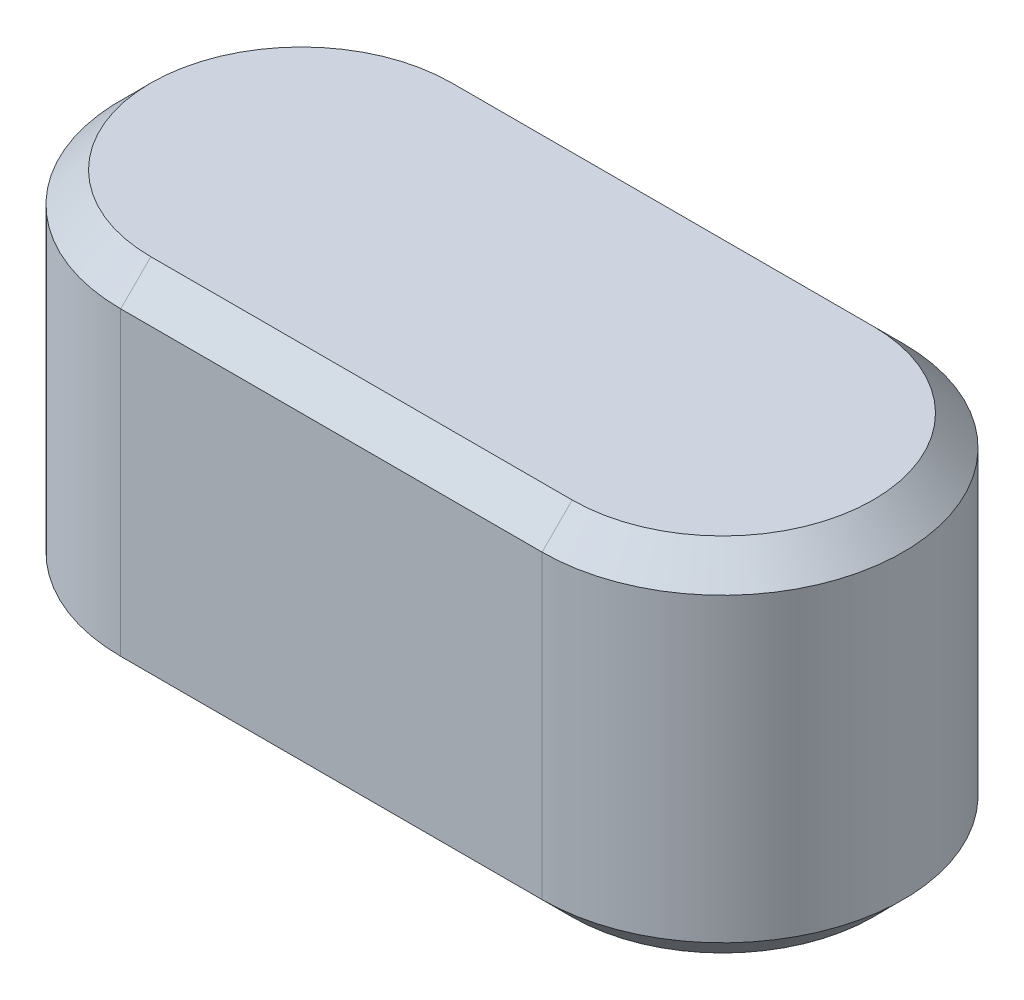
ISO-10303-21;
HEADER;
FILE_DESCRIPTION(('STEP AP214'),'2;1');
FILE_NAME('part.step','',(''),(''),'','','');
FILE_SCHEMA(('AUTOMOTIVE_DESIGN { 1 0 10303 214 1 1 1 1 }'));
ENDSEC;
DATA;
#1=APPLICATION_CONTEXT('core data for automotive mechanical design processes');
#2=APPLICATION_PROTOCOL_DEFINITION('international standard','automotive_design',2000,#1);
#3=PRODUCT_CONTEXT('',#1,'mechanical');
#4=PRODUCT('Part','Part','',(#3));
#5=PRODUCT_RELATED_PRODUCT_CATEGORY('part','',(#4));
#6=PRODUCT_DEFINITION_FORMATION('','',#4);
#7=PRODUCT_DEFINITION_CONTEXT('part definition',#1,'design');
#8=PRODUCT_DEFINITION('design','',#6,#7);
#9=PRODUCT_DEFINITION_SHAPE('','',#8);
#10=(LENGTH_UNIT() NAMED_UNIT(*) SI_UNIT(.MILLI.,.METRE.));
#11=(NAMED_UNIT(*) PLANE_ANGLE_UNIT() SI_UNIT($,.RADIAN.));
#12=(NAMED_UNIT(*) SI_UNIT($,.STERADIAN.) SOLID_ANGLE_UNIT());
#13=UNCERTAINTY_MEASURE_WITH_UNIT(LENGTH_MEASURE(1.E-05),#10,'distance_accuracy_value','');
#14=(GEOMETRIC_REPRESENTATION_CONTEXT(3) GLOBAL_UNCERTAINTY_ASSIGNED_CONTEXT((#13)) GLOBAL_UNIT_ASSIGNED_CONTEXT((#10,
#11,#12)) REPRESENTATION_CONTEXT('',''));
#15=CARTESIAN_POINT('',(0.,0.,0.));
#16=DIRECTION('',(0.,0.,1.));
#17=DIRECTION('',(1.,0.,0.));
#18=AXIS2_PLACEMENT_3D('',#15,#16,#17);
#19=CARTESIAN_POINT('',(3.5,6.00000000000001,0.));
#20=DIRECTION('',(0.,-1.,0.));
#21=DIRECTION('',(0.,0.,-1.));
#22=AXIS2_PLACEMENT_3D('',#19,#20,#21);
#23=CYLINDRICAL_SURFACE('',#22,2.99999999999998);
#24=DIRECTION('',(0.,-1.,0.));
#25=VECTOR('',#24,1.);
#26=CARTESIAN_POINT('',(3.5,6.00000000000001,-2.99999999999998));
#27=LINE('',#26,#25);
#28=CARTESIAN_POINT('',(3.5,5.49999999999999,-2.99999999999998));
#29=VERTEX_POINT('',#28);
#30=CARTESIAN_POINT('',(3.5,0.500000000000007,-2.99999999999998));
#31=VERTEX_POINT('',#30);
#32=EDGE_CURVE('E110',#29,#31,#27,.T.);
#33=ORIENTED_EDGE('',*,*,#32,.F.);
#34=CARTESIAN_POINT('',(3.5,5.49999999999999,0.));
#35=DIRECTION('',(0.,-1.,0.));
#36=DIRECTION('',(0.,0.,-1.));
#37=AXIS2_PLACEMENT_3D('',#34,#35,#36);
#38=CIRCLE('',#37,2.99999999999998);
#39=CARTESIAN_POINT('',(3.5,5.49999999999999,2.99999999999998));
#40=VERTEX_POINT('',#39);
#41=EDGE_CURVE('E134',#29,#40,#38,.T.);
#42=ORIENTED_EDGE('',*,*,#41,.T.);
#43=DIRECTION('',(0.,-1.,0.));
#44=VECTOR('',#43,1.);
#45=CARTESIAN_POINT('',(3.5,6.00000000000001,2.99999999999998));
#46=LINE('',#45,#44);
#47=CARTESIAN_POINT('',(3.5,0.500000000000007,2.99999999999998));
#48=VERTEX_POINT('',#47);
#49=EDGE_CURVE('E161',#40,#48,#46,.T.);
#50=ORIENTED_EDGE('',*,*,#49,.T.);
#51=CARTESIAN_POINT('',(3.5,0.500000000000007,0.));
#52=DIRECTION('',(0.,-1.,0.));
#53=DIRECTION('',(0.,0.,-1.));
#54=AXIS2_PLACEMENT_3D('',#51,#52,#53);
#55=CIRCLE('',#54,2.99999999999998);
#56=EDGE_CURVE('E132',#48,#31,#55,.F.);
#57=ORIENTED_EDGE('',*,*,#56,.T.);
#58=EDGE_LOOP('',(#33,#42,#50,#57));
#59=FACE_BOUND('',#58,.T.);
#60=ADVANCED_FACE('F27',(#59),#23,.T.);
#61=CARTESIAN_POINT('',(-3.5,6.00000000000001,-2.99999999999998));
#62=DIRECTION('',(0.,0.,1.));
#63=DIRECTION('',(1.,0.,0.));
#64=AXIS2_PLACEMENT_3D('',#61,#62,#63);
#65=PLANE('',#64);
#66=DIRECTION('',(0.,-1.,0.));
#67=VECTOR('',#66,1.);
#68=CARTESIAN_POINT('',(-3.5,6.00000000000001,-2.99999999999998));
#69=LINE('',#68,#67);
#70=CARTESIAN_POINT('',(-3.5,5.49999999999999,-2.99999999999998));
#71=VERTEX_POINT('',#70);
#72=CARTESIAN_POINT('',(-3.5,0.500000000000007,-2.99999999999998));
#73=VERTEX_POINT('',#72);
#74=EDGE_CURVE('E167',#71,#73,#69,.T.);
#75=ORIENTED_EDGE('',*,*,#74,.F.);
#76=DIRECTION('',(1.,0.,0.));
#77=VECTOR('',#76,1.);
#78=CARTESIAN_POINT('',(-3.5,5.49999999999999,-2.99999999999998));
#79=LINE('',#78,#77);
#80=EDGE_CURVE('E130',#71,#29,#79,.T.);
#81=ORIENTED_EDGE('',*,*,#80,.T.);
#82=ORIENTED_EDGE('',*,*,#32,.T.);
#83=DIRECTION('',(-1.,0.,0.));
#84=VECTOR('',#83,1.);
#85=CARTESIAN_POINT('',(-3.5,0.500000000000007,-2.99999999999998));
#86=LINE('',#85,#84);
#87=EDGE_CURVE('E127',#31,#73,#86,.T.);
#88=ORIENTED_EDGE('',*,*,#87,.T.);
#89=EDGE_LOOP('',(#75,#81,#82,#88));
#90=FACE_BOUND('',#89,.T.);
#91=ADVANCED_FACE('F192',(#90),#65,.F.);
#92=CARTESIAN_POINT('',(-3.5,6.00000000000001,0.));
#93=DIRECTION('',(0.,-1.,0.));
#94=DIRECTION('',(0.,0.,-1.));
#95=AXIS2_PLACEMENT_3D('',#92,#93,#94);
#96=CYLINDRICAL_SURFACE('',#95,2.99999999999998);
#97=DIRECTION('',(0.,-1.,0.));
#98=VECTOR('',#97,1.);
#99=CARTESIAN_POINT('',(-3.5,6.00000000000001,2.99999999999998));
#100=LINE('',#99,#98);
#101=CARTESIAN_POINT('',(-3.5,5.49999999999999,2.99999999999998));
#102=VERTEX_POINT('',#101);
#103=CARTESIAN_POINT('',(-3.5,0.500000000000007,2.99999999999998));
#104=VERTEX_POINT('',#103);
#105=EDGE_CURVE('E164',#102,#104,#100,.T.);
#106=ORIENTED_EDGE('',*,*,#105,.F.);
#107=CARTESIAN_POINT('',(-3.5,5.49999999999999,0.));
#108=DIRECTION('',(0.,-1.,0.));
#109=DIRECTION('',(0.,0.,-1.));
#110=AXIS2_PLACEMENT_3D('',#107,#108,#109);
#111=CIRCLE('',#110,2.99999999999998);
#112=EDGE_CURVE('E125',#102,#71,#111,.T.);
#113=ORIENTED_EDGE('',*,*,#112,.T.);
#114=ORIENTED_EDGE('',*,*,#74,.T.);
#115=CARTESIAN_POINT('',(-3.5,0.500000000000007,0.));
#116=DIRECTION('',(0.,-1.,0.));
#117=DIRECTION('',(0.,0.,-1.));
#118=AXIS2_PLACEMENT_3D('',#115,#116,#117);
#119=CIRCLE('',#118,2.99999999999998);
#120=EDGE_CURVE('E123',#73,#104,#119,.F.);
#121=ORIENTED_EDGE('',*,*,#120,.T.);
#122=EDGE_LOOP('',(#106,#113,#114,#121));
#123=FACE_BOUND('',#122,.T.);
#124=ADVANCED_FACE('F184',(#123),#96,.T.);
#125=CARTESIAN_POINT('',(-3.5,6.00000000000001,2.99999999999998));
#126=DIRECTION('',(0.,0.,-1.));
#127=DIRECTION('',(-1.,0.,0.));
#128=AXIS2_PLACEMENT_3D('',#125,#126,#127);
#129=PLANE('',#128);
#130=ORIENTED_EDGE('',*,*,#49,.F.);
#131=DIRECTION('',(-1.,0.,0.));
#132=VECTOR('',#131,1.);
#133=CARTESIAN_POINT('',(-3.5,5.49999999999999,2.99999999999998));
#134=LINE('',#133,#132);
#135=EDGE_CURVE('E96',#40,#102,#134,.T.);
#136=ORIENTED_EDGE('',*,*,#135,.T.);
#137=ORIENTED_EDGE('',*,*,#105,.T.);
#138=DIRECTION('',(1.,0.,0.));
#139=VECTOR('',#138,1.);
#140=CARTESIAN_POINT('',(3.5,0.500000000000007,2.99999999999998));
#141=LINE('',#140,#139);
#142=EDGE_CURVE('E116',#104,#48,#141,.T.);
#143=ORIENTED_EDGE('',*,*,#142,.T.);
#144=EDGE_LOOP('',(#130,#136,#137,#143));
#145=FACE_BOUND('',#144,.T.);
#146=ADVANCED_FACE('F183',(#145),#129,.F.);
#147=CARTESIAN_POINT('',(3.5,6.00000000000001,0.));
#148=DIRECTION('',(0.,-1.,0.));
#149=DIRECTION('',(0.,0.,-1.));
#150=AXIS2_PLACEMENT_3D('',#147,#148,#149);
#151=PLANE('',#150);
#152=CARTESIAN_POINT('',(-3.5,6.00000000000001,0.));
#153=DIRECTION('',(0.,-1.,0.));
#154=DIRECTION('',(0.,0.,-1.));
#155=AXIS2_PLACEMENT_3D('',#152,#153,#154);
#156=CIRCLE('',#155,2.49999999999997);
#157=CARTESIAN_POINT('',(-3.5,6.00000000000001,-2.49999999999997));
#158=VERTEX_POINT('',#157);
#159=CARTESIAN_POINT('',(-3.5,6.00000000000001,2.49999999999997));
#160=VERTEX_POINT('',#159);
#161=EDGE_CURVE('E114',#158,#160,#156,.F.);
#162=ORIENTED_EDGE('',*,*,#161,.T.);
#163=DIRECTION('',(1.,0.,0.));
#164=VECTOR('',#163,1.);
#165=CARTESIAN_POINT('',(3.5,6.00000000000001,2.49999999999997));
#166=LINE('',#165,#164);
#167=CARTESIAN_POINT('',(3.5,6.00000000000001,2.49999999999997));
#168=VERTEX_POINT('',#167);
#169=EDGE_CURVE('E94',#160,#168,#166,.T.);
#170=ORIENTED_EDGE('',*,*,#169,.T.);
#171=CARTESIAN_POINT('',(3.5,6.00000000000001,0.));
#172=DIRECTION('',(0.,-1.,0.));
#173=DIRECTION('',(0.,0.,-1.));
#174=AXIS2_PLACEMENT_3D('',#171,#172,#173);
#175=CIRCLE('',#174,2.49999999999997);
#176=CARTESIAN_POINT('',(3.5,6.00000000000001,-2.49999999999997));
#177=VERTEX_POINT('',#176);
#178=EDGE_CURVE('E103',#168,#177,#175,.F.);
#179=ORIENTED_EDGE('',*,*,#178,.T.);
#180=DIRECTION('',(-1.,0.,0.));
#181=VECTOR('',#180,1.);
#182=CARTESIAN_POINT('',(3.5,6.00000000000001,-2.49999999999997));
#183=LINE('',#182,#181);
#184=EDGE_CURVE('E109',#177,#158,#183,.T.);
#185=ORIENTED_EDGE('',*,*,#184,.T.);
#186=EDGE_LOOP('',(#162,#170,#179,#185));
#187=FACE_BOUND('',#186,.T.);
#188=ADVANCED_FACE('F112',(#187),#151,.F.);
#189=CARTESIAN_POINT('',(3.5,0.,0.));
#190=DIRECTION('',(0.,-1.,0.));
#191=DIRECTION('',(0.,0.,-1.));
#192=AXIS2_PLACEMENT_3D('',#189,#190,#191);
#193=PLANE('',#192);
#194=CARTESIAN_POINT('',(-3.5,0.,0.));
#195=DIRECTION('',(0.,-1.,0.));
#196=DIRECTION('',(0.,0.,-1.));
#197=AXIS2_PLACEMENT_3D('',#194,#195,#196);
#198=CIRCLE('',#197,2.49999999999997);
#199=CARTESIAN_POINT('',(-3.5,0.,2.49999999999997));
#200=VERTEX_POINT('',#199);
#201=CARTESIAN_POINT('',(-3.5,0.,-2.49999999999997));
#202=VERTEX_POINT('',#201);
#203=EDGE_CURVE('E34',#200,#202,#198,.T.);
#204=ORIENTED_EDGE('',*,*,#203,.T.);
#205=DIRECTION('',(1.,0.,0.));
#206=VECTOR('',#205,1.);
#207=CARTESIAN_POINT('',(3.5,0.,-2.49999999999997));
#208=LINE('',#207,#206);
#209=CARTESIAN_POINT('',(3.5,0.,-2.49999999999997));
#210=VERTEX_POINT('',#209);
#211=EDGE_CURVE('E11',#202,#210,#208,.T.);
#212=ORIENTED_EDGE('',*,*,#211,.T.);
#213=CARTESIAN_POINT('',(3.5,0.,0.));
#214=DIRECTION('',(0.,-1.,0.));
#215=DIRECTION('',(0.,0.,-1.));
#216=AXIS2_PLACEMENT_3D('',#213,#214,#215);
#217=CIRCLE('',#216,2.49999999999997);
#218=CARTESIAN_POINT('',(3.5,0.,2.49999999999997));
#219=VERTEX_POINT('',#218);
#220=EDGE_CURVE('E136',#210,#219,#217,.T.);
#221=ORIENTED_EDGE('',*,*,#220,.T.);
#222=DIRECTION('',(-1.,0.,0.));
#223=VECTOR('',#222,1.);
#224=CARTESIAN_POINT('',(-3.5,0.,2.49999999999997));
#225=LINE('',#224,#223);
#226=EDGE_CURVE('E44',#219,#200,#225,.T.);
#227=ORIENTED_EDGE('',*,*,#226,.T.);
#228=EDGE_LOOP('',(#204,#212,#221,#227));
#229=FACE_BOUND('',#228,.T.);
#230=ADVANCED_FACE('F139',(#229),#193,.T.);
#231=CARTESIAN_POINT('',(3.5,6.00000000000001,-2.49999999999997));
#232=DIRECTION('',(0.,-0.707106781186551,0.707106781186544));
#233=DIRECTION('',(0.,-0.707106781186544,-0.707106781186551));
#234=AXIS2_PLACEMENT_3D('',#231,#232,#233);
#235=PLANE('',#234);
#236=DIRECTION('',(0.,0.707106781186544,0.707106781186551));
#237=VECTOR('',#236,1.);
#238=CARTESIAN_POINT('',(3.5,5.49999999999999,-2.99999999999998));
#239=LINE('',#238,#237);
#240=EDGE_CURVE('E106',#29,#177,#239,.T.);
#241=ORIENTED_EDGE('',*,*,#240,.F.);
#242=ORIENTED_EDGE('',*,*,#80,.F.);
#243=DIRECTION('',(0.,-0.707106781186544,-0.707106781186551));
#244=VECTOR('',#243,1.);
#245=CARTESIAN_POINT('',(-3.5,6.00000000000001,-2.49999999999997));
#246=LINE('',#245,#244);
#247=EDGE_CURVE('E158',#158,#71,#246,.T.);
#248=ORIENTED_EDGE('',*,*,#247,.F.);
#249=ORIENTED_EDGE('',*,*,#184,.F.);
#250=EDGE_LOOP('',(#241,#242,#248,#249));
#251=FACE_BOUND('',#250,.T.);
#252=ADVANCED_FACE('F174',(#251),#235,.F.);
#253=CARTESIAN_POINT('',(-3.5,6.00000000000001,0.));
#254=DIRECTION('',(0.,-1.,0.));
#255=DIRECTION('',(0.,0.,-1.));
#256=AXIS2_PLACEMENT_3D('',#253,#254,#255);
#257=CONICAL_SURFACE('',#256,2.49999999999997,0.785398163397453);
#258=ORIENTED_EDGE('',*,*,#247,.T.);
#259=ORIENTED_EDGE('',*,*,#112,.F.);
#260=DIRECTION('',(0.,-0.707106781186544,0.707106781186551));
#261=VECTOR('',#260,1.);
#262=CARTESIAN_POINT('',(-3.5,6.00000000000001,2.49999999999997));
#263=LINE('',#262,#261);
#264=EDGE_CURVE('E99',#160,#102,#263,.T.);
#265=ORIENTED_EDGE('',*,*,#264,.F.);
#266=ORIENTED_EDGE('',*,*,#161,.F.);
#267=EDGE_LOOP('',(#258,#259,#265,#266));
#268=FACE_BOUND('',#267,.T.);
#269=ADVANCED_FACE('F177',(#268),#257,.T.);
#270=CARTESIAN_POINT('',(3.5,6.00000000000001,0.));
#271=DIRECTION('',(0.,-1.,0.));
#272=DIRECTION('',(0.,0.,-1.));
#273=AXIS2_PLACEMENT_3D('',#270,#271,#272);
#274=CONICAL_SURFACE('',#273,2.49999999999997,0.785398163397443);
#275=ORIENTED_EDGE('',*,*,#240,.T.);
#276=ORIENTED_EDGE('',*,*,#178,.F.);
#277=DIRECTION('',(0.,0.707106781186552,-0.707106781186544));
#278=VECTOR('',#277,1.);
#279=CARTESIAN_POINT('',(3.5,5.49999999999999,2.99999999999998));
#280=LINE('',#279,#278);
#281=EDGE_CURVE('E90',#40,#168,#280,.T.);
#282=ORIENTED_EDGE('',*,*,#281,.F.);
#283=ORIENTED_EDGE('',*,*,#41,.F.);
#284=EDGE_LOOP('',(#275,#276,#282,#283));
#285=FACE_BOUND('',#284,.T.);
#286=ADVANCED_FACE('F104',(#285),#274,.T.);
#287=CARTESIAN_POINT('',(3.5,6.00000000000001,2.49999999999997));
#288=DIRECTION('',(0.,-0.707106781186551,-0.707106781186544));
#289=DIRECTION('',(0.,0.707106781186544,-0.707106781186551));
#290=AXIS2_PLACEMENT_3D('',#287,#288,#289);
#291=PLANE('',#290);
#292=ORIENTED_EDGE('',*,*,#264,.T.);
#293=ORIENTED_EDGE('',*,*,#135,.F.);
#294=ORIENTED_EDGE('',*,*,#281,.T.);
#295=ORIENTED_EDGE('',*,*,#169,.F.);
#296=EDGE_LOOP('',(#292,#293,#294,#295));
#297=FACE_BOUND('',#296,.T.);
#298=ADVANCED_FACE('F92',(#297),#291,.F.);
#299=CARTESIAN_POINT('',(-3.5,0.500000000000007,2.99999999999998));
#300=DIRECTION('',(0.,-0.707106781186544,0.707106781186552));
#301=DIRECTION('',(0.,-0.707106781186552,-0.707106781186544));
#302=AXIS2_PLACEMENT_3D('',#299,#300,#301);
#303=PLANE('',#302);
#304=DIRECTION('',(0.,0.707106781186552,0.707106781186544));
#305=VECTOR('',#304,1.);
#306=CARTESIAN_POINT('',(-3.5,0.,2.49999999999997));
#307=LINE('',#306,#305);
#308=EDGE_CURVE('E149',#200,#104,#307,.T.);
#309=ORIENTED_EDGE('',*,*,#308,.F.);
#310=ORIENTED_EDGE('',*,*,#226,.F.);
#311=DIRECTION('',(0.,-0.707106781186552,-0.707106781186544));
#312=VECTOR('',#311,1.);
#313=CARTESIAN_POINT('',(3.5,0.500000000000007,2.99999999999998));
#314=LINE('',#313,#312);
#315=EDGE_CURVE('E100',#48,#219,#314,.T.);
#316=ORIENTED_EDGE('',*,*,#315,.F.);
#317=ORIENTED_EDGE('',*,*,#142,.F.);
#318=EDGE_LOOP('',(#309,#310,#316,#317));
#319=FACE_BOUND('',#318,.T.);
#320=ADVANCED_FACE('F145',(#319),#303,.T.);
#321=CARTESIAN_POINT('',(3.5,0.500000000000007,0.));
#322=DIRECTION('',(0.,1.,0.));
#323=DIRECTION('',(0.,0.,1.));
#324=AXIS2_PLACEMENT_3D('',#321,#322,#323);
#325=CONICAL_SURFACE('',#324,2.99999999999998,0.785398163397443);
#326=ORIENTED_EDGE('',*,*,#315,.T.);
#327=ORIENTED_EDGE('',*,*,#220,.F.);
#328=DIRECTION('',(0.,-0.707106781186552,0.707106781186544));
#329=VECTOR('',#328,1.);
#330=CARTESIAN_POINT('',(3.5,0.500000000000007,-2.99999999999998));
#331=LINE('',#330,#329);
#332=EDGE_CURVE('E152',#31,#210,#331,.T.);
#333=ORIENTED_EDGE('',*,*,#332,.F.);
#334=ORIENTED_EDGE('',*,*,#56,.F.);
#335=EDGE_LOOP('',(#326,#327,#333,#334));
#336=FACE_BOUND('',#335,.T.);
#337=ADVANCED_FACE('F150',(#336),#325,.T.);
#338=CARTESIAN_POINT('',(-3.5,0.500000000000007,0.));
#339=DIRECTION('',(0.,1.,0.));
#340=DIRECTION('',(0.,0.,1.));
#341=AXIS2_PLACEMENT_3D('',#338,#339,#340);
#342=CONICAL_SURFACE('',#341,2.99999999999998,0.785398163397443);
#343=ORIENTED_EDGE('',*,*,#308,.T.);
#344=ORIENTED_EDGE('',*,*,#120,.F.);
#345=DIRECTION('',(0.,0.707106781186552,-0.707106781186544));
#346=VECTOR('',#345,1.);
#347=CARTESIAN_POINT('',(-3.5,0.,-2.49999999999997));
#348=LINE('',#347,#346);
#349=EDGE_CURVE('E189',#202,#73,#348,.T.);
#350=ORIENTED_EDGE('',*,*,#349,.F.);
#351=ORIENTED_EDGE('',*,*,#203,.F.);
#352=EDGE_LOOP('',(#343,#344,#350,#351));
#353=FACE_BOUND('',#352,.T.);
#354=ADVANCED_FACE('F188',(#353),#342,.T.);
#355=CARTESIAN_POINT('',(-3.5,0.500000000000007,-2.99999999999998));
#356=DIRECTION('',(0.,-0.707106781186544,-0.707106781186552));
#357=DIRECTION('',(0.,0.707106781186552,-0.707106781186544));
#358=AXIS2_PLACEMENT_3D('',#355,#356,#357);
#359=PLANE('',#358);
#360=ORIENTED_EDGE('',*,*,#332,.T.);
#361=ORIENTED_EDGE('',*,*,#211,.F.);
#362=ORIENTED_EDGE('',*,*,#349,.T.);
#363=ORIENTED_EDGE('',*,*,#87,.F.);
#364=EDGE_LOOP('',(#360,#361,#362,#363));
#365=FACE_BOUND('',#364,.T.);
#366=ADVANCED_FACE('F195',(#365),#359,.T.);
#367=CLOSED_SHELL('',(#60,#91,#124,#146,#188,#230,#252,#269,#286,#298,#320,#337,#354,#366));
#368=MANIFOLD_SOLID_BREP('B2',#367);
#369=ADVANCED_BREP_SHAPE_REPRESENTATION('',(#18,#368),#14);
#370=SHAPE_DEFINITION_REPRESENTATION(#9,#369);
ENDSEC;
END-ISO-10303-21;
